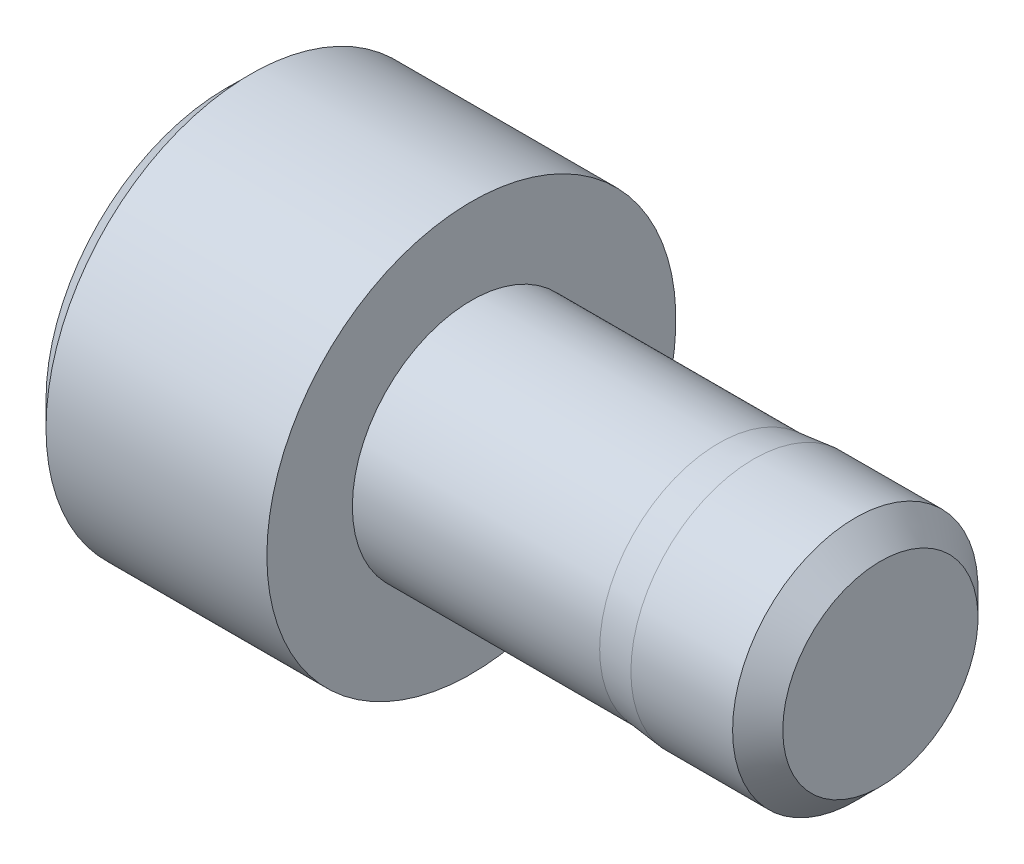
ISO-10303-21;
HEADER;
FILE_DESCRIPTION(('STEP AP214'),'2;1');
FILE_NAME('part.step','',(''),(''),'','','');
FILE_SCHEMA(('AUTOMOTIVE_DESIGN { 1 0 10303 214 1 1 1 1 }'));
ENDSEC;
DATA;
#1=APPLICATION_CONTEXT('core data for automotive mechanical design processes');
#2=APPLICATION_PROTOCOL_DEFINITION('international standard','automotive_design',2000,#1);
#3=PRODUCT_CONTEXT('',#1,'mechanical');
#4=PRODUCT('Part','Part','',(#3));
#5=PRODUCT_RELATED_PRODUCT_CATEGORY('part','',(#4));
#6=PRODUCT_DEFINITION_FORMATION('','',#4);
#7=PRODUCT_DEFINITION_CONTEXT('part definition',#1,'design');
#8=PRODUCT_DEFINITION('design','',#6,#7);
#9=PRODUCT_DEFINITION_SHAPE('','',#8);
#10=(LENGTH_UNIT() NAMED_UNIT(*) SI_UNIT(.MILLI.,.METRE.));
#11=(NAMED_UNIT(*) PLANE_ANGLE_UNIT() SI_UNIT($,.RADIAN.));
#12=(NAMED_UNIT(*) SI_UNIT($,.STERADIAN.) SOLID_ANGLE_UNIT());
#13=UNCERTAINTY_MEASURE_WITH_UNIT(LENGTH_MEASURE(1.E-05),#10,'distance_accuracy_value','');
#14=(GEOMETRIC_REPRESENTATION_CONTEXT(3) GLOBAL_UNCERTAINTY_ASSIGNED_CONTEXT((#13)) GLOBAL_UNIT_ASSIGNED_CONTEXT((#10,
#11,#12)) REPRESENTATION_CONTEXT('',''));
#15=CARTESIAN_POINT('',(0.,0.,0.));
#16=DIRECTION('',(0.,0.,1.));
#17=DIRECTION('',(1.,0.,0.));
#18=AXIS2_PLACEMENT_3D('',#15,#16,#17);
#19=CARTESIAN_POINT('',(10.,2.3865,0.));
#20=DIRECTION('',(-1.,0.,0.));
#21=DIRECTION('',(0.,0.,1.));
#22=AXIS2_PLACEMENT_3D('',#19,#20,#21);
#23=PLANE('',#22);
#24=CARTESIAN_POINT('',(9.99999999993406,0.,0.));
#25=DIRECTION('',(-1.,0.,0.));
#26=DIRECTION('',(0.,0.,1.));
#27=AXIS2_PLACEMENT_3D('',#24,#25,#26);
#28=CIRCLE('',#27,2.38650000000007);
#29=CARTESIAN_POINT('',(9.99999999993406,0.,2.38650000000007));
#30=VERTEX_POINT('',#29);
#31=EDGE_CURVE('E19',#30,#30,#28,.T.);
#32=ORIENTED_EDGE('',*,*,#31,.F.);
#33=EDGE_LOOP('',(#32));
#34=FACE_BOUND('',#33,.T.);
#35=ADVANCED_FACE('F16',(#34),#23,.F.);
#36=CARTESIAN_POINT('',(-3.,0.,0.));
#37=DIRECTION('',(1.,0.,0.));
#38=DIRECTION('',(0.,0.,-1.));
#39=AXIS2_PLACEMENT_3D('',#36,#37,#38);
#40=PLANE('',#39);
#41=DIRECTION('',(0.,1.,0.));
#42=VECTOR('',#41,1.);
#43=CARTESIAN_POINT('',(-3.,0.,2.5));
#44=LINE('',#43,#42);
#45=CARTESIAN_POINT('',(-3.,1.44337567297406,2.5));
#46=VERTEX_POINT('',#45);
#47=CARTESIAN_POINT('',(-2.99999999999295,0.,2.49999999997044));
#48=VERTEX_POINT('',#47);
#49=EDGE_CURVE('E110',#46,#48,#44,.F.);
#50=ORIENTED_EDGE('',*,*,#49,.F.);
#51=DIRECTION('',(0.,-0.500000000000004,0.866025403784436));
#52=VECTOR('',#51,1.);
#53=CARTESIAN_POINT('',(-3.,2.1650635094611,1.25));
#54=LINE('',#53,#52);
#55=CARTESIAN_POINT('',(-2.99999999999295,2.1650635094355,1.24999999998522));
#56=VERTEX_POINT('',#55);
#57=EDGE_CURVE('E92',#56,#46,#54,.T.);
#58=ORIENTED_EDGE('',*,*,#57,.F.);
#59=CARTESIAN_POINT('',(-2.9999999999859,0.,0.));
#60=DIRECTION('',(-1.,0.,0.));
#61=DIRECTION('',(0.,0.,1.));
#62=AXIS2_PLACEMENT_3D('',#59,#60,#61);
#63=CIRCLE('',#62,2.49999999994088);
#64=EDGE_CURVE('E107',#56,#48,#63,.F.);
#65=ORIENTED_EDGE('',*,*,#64,.T.);
#66=EDGE_LOOP('',(#50,#58,#65));
#67=FACE_BOUND('',#66,.T.);
#68=ADVANCED_FACE('F105',(#67),#40,.F.);
#69=CARTESIAN_POINT('',(-3.,0.,0.));
#70=DIRECTION('',(1.,0.,0.));
#71=DIRECTION('',(0.,0.,-1.));
#72=AXIS2_PLACEMENT_3D('',#69,#70,#71);
#73=PLANE('',#72);
#74=DIRECTION('',(0.,0.499999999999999,-0.866025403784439));
#75=VECTOR('',#74,1.);
#76=CARTESIAN_POINT('',(-3.,-2.88675134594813,0.));
#77=LINE('',#76,#75);
#78=CARTESIAN_POINT('',(-3.,-2.88675134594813,0.));
#79=VERTEX_POINT('',#78);
#80=CARTESIAN_POINT('',(-2.99999999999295,-2.1650635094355,-1.24999999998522));
#81=VERTEX_POINT('',#80);
#82=EDGE_CURVE('E177',#79,#81,#77,.T.);
#83=ORIENTED_EDGE('',*,*,#82,.F.);
#84=DIRECTION('',(0.,-0.499999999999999,-0.866025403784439));
#85=VECTOR('',#84,1.);
#86=CARTESIAN_POINT('',(-3.,-2.1650635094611,1.25));
#87=LINE('',#86,#85);
#88=CARTESIAN_POINT('',(-2.99999999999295,-2.1650635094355,1.24999999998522));
#89=VERTEX_POINT('',#88);
#90=EDGE_CURVE('E173',#89,#79,#87,.T.);
#91=ORIENTED_EDGE('',*,*,#90,.F.);
#92=CARTESIAN_POINT('',(-2.9999999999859,0.,0.));
#93=DIRECTION('',(-1.,0.,0.));
#94=DIRECTION('',(0.,0.,1.));
#95=AXIS2_PLACEMENT_3D('',#92,#93,#94);
#96=CIRCLE('',#95,2.49999999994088);
#97=EDGE_CURVE('E125',#89,#81,#96,.F.);
#98=ORIENTED_EDGE('',*,*,#97,.T.);
#99=EDGE_LOOP('',(#83,#91,#98));
#100=FACE_BOUND('',#99,.T.);
#101=ADVANCED_FACE('F257',(#100),#73,.F.);
#102=CARTESIAN_POINT('',(-3.,0.,0.));
#103=DIRECTION('',(1.,0.,0.));
#104=DIRECTION('',(0.,0.,-1.));
#105=AXIS2_PLACEMENT_3D('',#102,#103,#104);
#106=PLANE('',#105);
#107=DIRECTION('',(0.,1.,0.));
#108=VECTOR('',#107,1.);
#109=CARTESIAN_POINT('',(-3.,0.,-2.5));
#110=LINE('',#109,#108);
#111=CARTESIAN_POINT('',(-3.,-1.44337567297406,-2.5));
#112=VERTEX_POINT('',#111);
#113=CARTESIAN_POINT('',(-2.99999999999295,0.,-2.49999999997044));
#114=VERTEX_POINT('',#113);
#115=EDGE_CURVE('E185',#112,#114,#110,.T.);
#116=ORIENTED_EDGE('',*,*,#115,.F.);
#117=DIRECTION('',(0.,0.500000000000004,-0.866025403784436));
#118=VECTOR('',#117,1.);
#119=CARTESIAN_POINT('',(-3.,-2.1650635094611,-1.25));
#120=LINE('',#119,#118);
#121=EDGE_CURVE('E181',#81,#112,#120,.T.);
#122=ORIENTED_EDGE('',*,*,#121,.F.);
#123=CARTESIAN_POINT('',(-2.9999999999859,0.,0.));
#124=DIRECTION('',(-1.,0.,0.));
#125=DIRECTION('',(0.,0.,1.));
#126=AXIS2_PLACEMENT_3D('',#123,#124,#125);
#127=CIRCLE('',#126,2.49999999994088);
#128=EDGE_CURVE('E127',#81,#114,#127,.F.);
#129=ORIENTED_EDGE('',*,*,#128,.T.);
#130=EDGE_LOOP('',(#116,#122,#129));
#131=FACE_BOUND('',#130,.T.);
#132=ADVANCED_FACE('F263',(#131),#106,.F.);
#133=CARTESIAN_POINT('',(-3.,0.,0.));
#134=DIRECTION('',(1.,0.,0.));
#135=DIRECTION('',(0.,0.,-1.));
#136=AXIS2_PLACEMENT_3D('',#133,#134,#135);
#137=PLANE('',#136);
#138=DIRECTION('',(0.,0.500000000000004,0.866025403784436));
#139=VECTOR('',#138,1.);
#140=CARTESIAN_POINT('',(-3.,1.44337567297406,-2.5));
#141=LINE('',#140,#139);
#142=CARTESIAN_POINT('',(-3.,1.44337567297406,-2.5));
#143=VERTEX_POINT('',#142);
#144=CARTESIAN_POINT('',(-2.99999999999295,2.1650635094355,-1.24999999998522));
#145=VERTEX_POINT('',#144);
#146=EDGE_CURVE('E100',#143,#145,#141,.T.);
#147=ORIENTED_EDGE('',*,*,#146,.F.);
#148=DIRECTION('',(0.,1.,0.));
#149=VECTOR('',#148,1.);
#150=CARTESIAN_POINT('',(-3.,0.,-2.5));
#151=LINE('',#150,#149);
#152=EDGE_CURVE('E189',#114,#143,#151,.T.);
#153=ORIENTED_EDGE('',*,*,#152,.F.);
#154=CARTESIAN_POINT('',(-2.9999999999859,0.,0.));
#155=DIRECTION('',(-1.,0.,0.));
#156=DIRECTION('',(0.,0.,1.));
#157=AXIS2_PLACEMENT_3D('',#154,#155,#156);
#158=CIRCLE('',#157,2.49999999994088);
#159=EDGE_CURVE('E118',#114,#145,#158,.F.);
#160=ORIENTED_EDGE('',*,*,#159,.T.);
#161=EDGE_LOOP('',(#147,#153,#160));
#162=FACE_BOUND('',#161,.T.);
#163=ADVANCED_FACE('F266',(#162),#137,.F.);
#164=CARTESIAN_POINT('',(-3.,0.,0.));
#165=DIRECTION('',(1.,0.,0.));
#166=DIRECTION('',(0.,0.,-1.));
#167=AXIS2_PLACEMENT_3D('',#164,#165,#166);
#168=PLANE('',#167);
#169=CARTESIAN_POINT('',(-2.9999999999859,0.,0.));
#170=DIRECTION('',(-1.,0.,0.));
#171=DIRECTION('',(0.,0.,1.));
#172=AXIS2_PLACEMENT_3D('',#169,#170,#171);
#173=CIRCLE('',#172,2.49999999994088);
#174=EDGE_CURVE('E113',#145,#56,#173,.F.);
#175=ORIENTED_EDGE('',*,*,#174,.T.);
#176=DIRECTION('',(0.,-0.499999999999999,0.866025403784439));
#177=VECTOR('',#176,1.);
#178=CARTESIAN_POINT('',(-3.,2.88675134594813,0.));
#179=LINE('',#178,#177);
#180=CARTESIAN_POINT('',(-3.,2.88675134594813,0.));
#181=VERTEX_POINT('',#180);
#182=EDGE_CURVE('E88',#181,#56,#179,.T.);
#183=ORIENTED_EDGE('',*,*,#182,.F.);
#184=DIRECTION('',(0.,0.499999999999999,0.866025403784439));
#185=VECTOR('',#184,1.);
#186=CARTESIAN_POINT('',(-3.,2.1650635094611,-1.25));
#187=LINE('',#186,#185);
#188=EDGE_CURVE('E99',#145,#181,#187,.T.);
#189=ORIENTED_EDGE('',*,*,#188,.F.);
#190=EDGE_LOOP('',(#175,#183,#189));
#191=FACE_BOUND('',#190,.T.);
#192=ADVANCED_FACE('F114',(#191),#168,.F.);
#193=CARTESIAN_POINT('',(9.38650000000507,0.,0.));
#194=DIRECTION('',(-1.,0.,0.));
#195=DIRECTION('',(0.,0.,1.));
#196=AXIS2_PLACEMENT_3D('',#193,#194,#195);
#197=CONICAL_SURFACE('',#196,2.9999999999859,0.785398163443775);
#198=CARTESIAN_POINT('',(9.3865,0.,0.));
#199=DIRECTION('',(-1.,0.,0.));
#200=DIRECTION('',(0.,0.,1.));
#201=AXIS2_PLACEMENT_3D('',#198,#199,#200);
#202=CIRCLE('',#201,3.);
#203=CARTESIAN_POINT('',(9.3865,0.,3.));
#204=VERTEX_POINT('',#203);
#205=EDGE_CURVE('E117',#204,#204,#202,.T.);
#206=ORIENTED_EDGE('',*,*,#205,.F.);
#207=EDGE_LOOP('',(#206));
#208=FACE_BOUND('',#207,.T.);
#209=ORIENTED_EDGE('',*,*,#31,.T.);
#210=EDGE_LOOP('',(#209));
#211=FACE_BOUND('',#210,.T.);
#212=ADVANCED_FACE('F405',(#208,#211),#197,.T.);
#213=CARTESIAN_POINT('',(-2.9999999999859,0.,0.));
#214=DIRECTION('',(-1.,0.,0.));
#215=DIRECTION('',(0.,0.,1.));
#216=AXIS2_PLACEMENT_3D('',#213,#214,#215);
#217=CONICAL_SURFACE('',#216,2.49999999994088,1.04719755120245);
#218=CARTESIAN_POINT('',(-1.55662432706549,0.,0.));
#219=VERTEX_POINT('',#218);
#220=VERTEX_LOOP('',#219);
#221=FACE_BOUND('',#220,.T.);
#222=ORIENTED_EDGE('',*,*,#159,.F.);
#223=ORIENTED_EDGE('',*,*,#128,.F.);
#224=ORIENTED_EDGE('',*,*,#97,.F.);
#225=CARTESIAN_POINT('',(-2.9999999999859,0.,0.));
#226=DIRECTION('',(-1.,0.,0.));
#227=DIRECTION('',(0.,0.,1.));
#228=AXIS2_PLACEMENT_3D('',#225,#226,#227);
#229=CIRCLE('',#228,2.49999999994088);
#230=EDGE_CURVE('E123',#89,#48,#229,.T.);
#231=ORIENTED_EDGE('',*,*,#230,.T.);
#232=ORIENTED_EDGE('',*,*,#64,.F.);
#233=ORIENTED_EDGE('',*,*,#174,.F.);
#234=EDGE_LOOP('',(#222,#223,#224,#231,#232,#233));
#235=FACE_BOUND('',#234,.T.);
#236=ADVANCED_FACE('F120',(#221,#235),#217,.F.);
#237=CARTESIAN_POINT('',(10.,0.,0.));
#238=DIRECTION('',(-1.,0.,0.));
#239=DIRECTION('',(0.,0.,1.));
#240=AXIS2_PLACEMENT_3D('',#237,#238,#239);
#241=CYLINDRICAL_SURFACE('',#240,3.);
#242=CARTESIAN_POINT('',(6.9000000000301,0.,0.));
#243=DIRECTION('',(1.,0.,0.));
#244=DIRECTION('',(0.,0.,-1.));
#245=AXIS2_PLACEMENT_3D('',#242,#243,#244);
#246=CIRCLE('',#245,2.99999999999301);
#247=CARTESIAN_POINT('',(6.9000000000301,0.,-2.99999999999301));
#248=VERTEX_POINT('',#247);
#249=EDGE_CURVE('E136',#248,#248,#246,.F.);
#250=ORIENTED_EDGE('',*,*,#249,.F.);
#251=EDGE_LOOP('',(#250));
#252=FACE_BOUND('',#251,.T.);
#253=ORIENTED_EDGE('',*,*,#205,.T.);
#254=EDGE_LOOP('',(#253));
#255=FACE_BOUND('',#254,.T.);
#256=ADVANCED_FACE('F389',(#252,#255),#241,.T.);
#257=CARTESIAN_POINT('',(-3.,0.,0.));
#258=DIRECTION('',(1.,0.,0.));
#259=DIRECTION('',(0.,0.,-1.));
#260=AXIS2_PLACEMENT_3D('',#257,#258,#259);
#261=PLANE('',#260);
#262=DIRECTION('',(0.,0.5,0.866025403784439));
#263=VECTOR('',#262,1.);
#264=CARTESIAN_POINT('',(-3.,-1.44337567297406,2.5));
#265=LINE('',#264,#263);
#266=CARTESIAN_POINT('',(-3.,-1.44337567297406,2.5));
#267=VERTEX_POINT('',#266);
#268=EDGE_CURVE('E207',#267,#89,#265,.F.);
#269=ORIENTED_EDGE('',*,*,#268,.F.);
#270=DIRECTION('',(0.,1.,0.));
#271=VECTOR('',#270,1.);
#272=CARTESIAN_POINT('',(-3.,1.44337567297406,2.5));
#273=LINE('',#272,#271);
#274=EDGE_CURVE('E210',#48,#267,#273,.F.);
#275=ORIENTED_EDGE('',*,*,#274,.F.);
#276=ORIENTED_EDGE('',*,*,#230,.F.);
#277=EDGE_LOOP('',(#269,#275,#276));
#278=FACE_BOUND('',#277,.T.);
#279=ADVANCED_FACE('F255',(#278),#261,.F.);
#280=CARTESIAN_POINT('',(6.89999999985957,0.,0.));
#281=DIRECTION('',(1.,0.,0.));
#282=DIRECTION('',(0.,1.,0.));
#283=AXIS2_PLACEMENT_3D('',#280,#281,#282);
#284=CONICAL_SURFACE('',#283,2.9999999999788,0.10508425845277);
#285=CARTESIAN_POINT('',(6.04669926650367,0.,0.));
#286=DIRECTION('',(-1.,0.,0.));
#287=DIRECTION('',(0.,0.,1.));
#288=AXIS2_PLACEMENT_3D('',#285,#286,#287);
#289=CIRCLE('',#288,2.91);
#290=CARTESIAN_POINT('',(6.04669926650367,0.,2.91));
#291=VERTEX_POINT('',#290);
#292=EDGE_CURVE('E161',#291,#291,#289,.T.);
#293=ORIENTED_EDGE('',*,*,#292,.F.);
#294=EDGE_LOOP('',(#293));
#295=FACE_BOUND('',#294,.T.);
#296=ORIENTED_EDGE('',*,*,#249,.T.);
#297=EDGE_LOOP('',(#296));
#298=FACE_BOUND('',#297,.T.);
#299=ADVANCED_FACE('F373',(#295,#298),#284,.T.);
#300=CARTESIAN_POINT('',(-3.,-1.44337567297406,2.5));
#301=DIRECTION('',(0.,0.866025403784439,-0.5));
#302=DIRECTION('',(0.,0.5,0.866025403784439));
#303=AXIS2_PLACEMENT_3D('',#300,#301,#302);
#304=PLANE('',#303);
#305=ORIENTED_EDGE('',*,*,#90,.T.);
#306=DIRECTION('',(1.,0.,0.));
#307=VECTOR('',#306,1.);
#308=CARTESIAN_POINT('',(-3.,-2.88675134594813,0.));
#309=LINE('',#308,#307);
#310=CARTESIAN_POINT('',(-6.,-2.88675134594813,0.));
#311=VERTEX_POINT('',#310);
#312=EDGE_CURVE('E153',#311,#79,#309,.T.);
#313=ORIENTED_EDGE('',*,*,#312,.F.);
#314=DIRECTION('',(0.,0.500000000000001,0.866025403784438));
#315=VECTOR('',#314,1.);
#316=CARTESIAN_POINT('',(-6.,-2.88675134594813,0.));
#317=LINE('',#316,#315);
#318=CARTESIAN_POINT('',(-6.,-1.44337567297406,2.5));
#319=VERTEX_POINT('',#318);
#320=EDGE_CURVE('E227',#311,#319,#317,.T.);
#321=ORIENTED_EDGE('',*,*,#320,.T.);
#322=DIRECTION('',(-1.,0.,0.));
#323=VECTOR('',#322,1.);
#324=CARTESIAN_POINT('',(-3.,-1.44337567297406,2.5));
#325=LINE('',#324,#323);
#326=EDGE_CURVE('E150',#267,#319,#325,.T.);
#327=ORIENTED_EDGE('',*,*,#326,.F.);
#328=ORIENTED_EDGE('',*,*,#268,.T.);
#329=EDGE_LOOP('',(#305,#313,#321,#327,#328));
#330=FACE_BOUND('',#329,.T.);
#331=ADVANCED_FACE('F251',(#330),#304,.T.);
#332=CARTESIAN_POINT('',(-3.,1.44337567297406,2.5));
#333=DIRECTION('',(0.,0.,-1.));
#334=DIRECTION('',(-1.,0.,0.));
#335=AXIS2_PLACEMENT_3D('',#332,#333,#334);
#336=PLANE('',#335);
#337=ORIENTED_EDGE('',*,*,#274,.T.);
#338=ORIENTED_EDGE('',*,*,#326,.T.);
#339=DIRECTION('',(0.,1.,0.));
#340=VECTOR('',#339,1.);
#341=CARTESIAN_POINT('',(-6.,0.,2.5));
#342=LINE('',#341,#340);
#343=CARTESIAN_POINT('',(-6.,1.44337567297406,2.5));
#344=VERTEX_POINT('',#343);
#345=EDGE_CURVE('E229',#319,#344,#342,.T.);
#346=ORIENTED_EDGE('',*,*,#345,.T.);
#347=DIRECTION('',(1.,0.,0.));
#348=VECTOR('',#347,1.);
#349=CARTESIAN_POINT('',(-3.,1.44337567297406,2.5));
#350=LINE('',#349,#348);
#351=EDGE_CURVE('E148',#46,#344,#350,.F.);
#352=ORIENTED_EDGE('',*,*,#351,.F.);
#353=ORIENTED_EDGE('',*,*,#49,.T.);
#354=EDGE_LOOP('',(#337,#338,#346,#352,#353));
#355=FACE_BOUND('',#354,.T.);
#356=ADVANCED_FACE('F253',(#355),#336,.T.);
#357=CARTESIAN_POINT('',(-3.,2.88675134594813,0.));
#358=DIRECTION('',(0.,-0.866025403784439,-0.5));
#359=DIRECTION('',(0.,0.5,-0.866025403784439));
#360=AXIS2_PLACEMENT_3D('',#357,#358,#359);
#361=PLANE('',#360);
#362=ORIENTED_EDGE('',*,*,#57,.T.);
#363=ORIENTED_EDGE('',*,*,#351,.T.);
#364=DIRECTION('',(0.,0.500000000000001,-0.866025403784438));
#365=VECTOR('',#364,1.);
#366=CARTESIAN_POINT('',(-6.,1.44337567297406,2.5));
#367=LINE('',#366,#365);
#368=CARTESIAN_POINT('',(-6.,2.88675134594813,0.));
#369=VERTEX_POINT('',#368);
#370=EDGE_CURVE('E231',#344,#369,#367,.T.);
#371=ORIENTED_EDGE('',*,*,#370,.T.);
#372=DIRECTION('',(1.,0.,0.));
#373=VECTOR('',#372,1.);
#374=CARTESIAN_POINT('',(-3.,2.88675134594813,0.));
#375=LINE('',#374,#373);
#376=EDGE_CURVE('E95',#181,#369,#375,.F.);
#377=ORIENTED_EDGE('',*,*,#376,.F.);
#378=ORIENTED_EDGE('',*,*,#182,.T.);
#379=EDGE_LOOP('',(#362,#363,#371,#377,#378));
#380=FACE_BOUND('',#379,.T.);
#381=ADVANCED_FACE('F90',(#380),#361,.T.);
#382=CARTESIAN_POINT('',(-3.,1.44337567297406,-2.5));
#383=DIRECTION('',(0.,-0.866025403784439,0.5));
#384=DIRECTION('',(0.,-0.5,-0.866025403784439));
#385=AXIS2_PLACEMENT_3D('',#382,#383,#384);
#386=PLANE('',#385);
#387=ORIENTED_EDGE('',*,*,#188,.T.);
#388=ORIENTED_EDGE('',*,*,#376,.T.);
#389=DIRECTION('',(0.,-0.500000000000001,-0.866025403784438));
#390=VECTOR('',#389,1.);
#391=CARTESIAN_POINT('',(-6.,2.88675134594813,0.));
#392=LINE('',#391,#390);
#393=CARTESIAN_POINT('',(-6.,1.44337567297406,-2.5));
#394=VERTEX_POINT('',#393);
#395=EDGE_CURVE('E233',#369,#394,#392,.T.);
#396=ORIENTED_EDGE('',*,*,#395,.T.);
#397=DIRECTION('',(1.,0.,0.));
#398=VECTOR('',#397,1.);
#399=CARTESIAN_POINT('',(-3.,1.44337567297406,-2.5));
#400=LINE('',#399,#398);
#401=EDGE_CURVE('E157',#143,#394,#400,.F.);
#402=ORIENTED_EDGE('',*,*,#401,.F.);
#403=ORIENTED_EDGE('',*,*,#146,.T.);
#404=EDGE_LOOP('',(#387,#388,#396,#402,#403));
#405=FACE_BOUND('',#404,.T.);
#406=ADVANCED_FACE('F270',(#405),#386,.T.);
#407=CARTESIAN_POINT('',(-3.,-1.44337567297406,-2.5));
#408=DIRECTION('',(0.,0.,1.));
#409=DIRECTION('',(1.,0.,0.));
#410=AXIS2_PLACEMENT_3D('',#407,#408,#409);
#411=PLANE('',#410);
#412=ORIENTED_EDGE('',*,*,#152,.T.);
#413=ORIENTED_EDGE('',*,*,#401,.T.);
#414=DIRECTION('',(0.,1.,0.));
#415=VECTOR('',#414,1.);
#416=CARTESIAN_POINT('',(-6.,0.,-2.5));
#417=LINE('',#416,#415);
#418=CARTESIAN_POINT('',(-6.,-1.44337567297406,-2.5));
#419=VERTEX_POINT('',#418);
#420=EDGE_CURVE('E34',#394,#419,#417,.F.);
#421=ORIENTED_EDGE('',*,*,#420,.T.);
#422=DIRECTION('',(1.,0.,0.));
#423=VECTOR('',#422,1.);
#424=CARTESIAN_POINT('',(-3.,-1.44337567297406,-2.5));
#425=LINE('',#424,#423);
#426=EDGE_CURVE('E156',#112,#419,#425,.F.);
#427=ORIENTED_EDGE('',*,*,#426,.F.);
#428=ORIENTED_EDGE('',*,*,#115,.T.);
#429=EDGE_LOOP('',(#412,#413,#421,#427,#428));
#430=FACE_BOUND('',#429,.T.);
#431=ADVANCED_FACE('F268',(#430),#411,.T.);
#432=CARTESIAN_POINT('',(-3.,-2.88675134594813,0.));
#433=DIRECTION('',(0.,0.866025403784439,0.5));
#434=DIRECTION('',(0.,-0.5,0.866025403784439));
#435=AXIS2_PLACEMENT_3D('',#432,#433,#434);
#436=PLANE('',#435);
#437=ORIENTED_EDGE('',*,*,#121,.T.);
#438=ORIENTED_EDGE('',*,*,#426,.T.);
#439=DIRECTION('',(0.,-0.500000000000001,0.866025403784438));
#440=VECTOR('',#439,1.);
#441=CARTESIAN_POINT('',(-6.,-1.44337567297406,-2.5));
#442=LINE('',#441,#440);
#443=EDGE_CURVE('E141',#419,#311,#442,.T.);
#444=ORIENTED_EDGE('',*,*,#443,.T.);
#445=ORIENTED_EDGE('',*,*,#312,.T.);
#446=ORIENTED_EDGE('',*,*,#82,.T.);
#447=EDGE_LOOP('',(#437,#438,#444,#445,#446));
#448=FACE_BOUND('',#447,.T.);
#449=ADVANCED_FACE('F242',(#448),#436,.T.);
#450=CARTESIAN_POINT('',(10.,0.,0.));
#451=DIRECTION('',(-1.,0.,0.));
#452=DIRECTION('',(0.,0.,1.));
#453=AXIS2_PLACEMENT_3D('',#450,#451,#452);
#454=CYLINDRICAL_SURFACE('',#453,2.91);
#455=CARTESIAN_POINT('',(0.,0.,0.));
#456=DIRECTION('',(-1.,0.,0.));
#457=DIRECTION('',(0.,0.,1.));
#458=AXIS2_PLACEMENT_3D('',#455,#456,#457);
#459=CIRCLE('',#458,2.91);
#460=CARTESIAN_POINT('',(0.,0.,2.91));
#461=VERTEX_POINT('',#460);
#462=EDGE_CURVE('E137',#461,#461,#459,.F.);
#463=ORIENTED_EDGE('',*,*,#462,.T.);
#464=EDGE_LOOP('',(#463));
#465=FACE_BOUND('',#464,.T.);
#466=ORIENTED_EDGE('',*,*,#292,.T.);
#467=EDGE_LOOP('',(#466));
#468=FACE_BOUND('',#467,.T.);
#469=ADVANCED_FACE('F299',(#465,#468),#454,.T.);
#470=CARTESIAN_POINT('',(-6.,0.,0.));
#471=DIRECTION('',(1.,0.,0.));
#472=DIRECTION('',(0.,0.,-1.));
#473=AXIS2_PLACEMENT_3D('',#470,#471,#472);
#474=PLANE('',#473);
#475=ORIENTED_EDGE('',*,*,#420,.F.);
#476=ORIENTED_EDGE('',*,*,#395,.F.);
#477=ORIENTED_EDGE('',*,*,#370,.F.);
#478=ORIENTED_EDGE('',*,*,#345,.F.);
#479=ORIENTED_EDGE('',*,*,#320,.F.);
#480=ORIENTED_EDGE('',*,*,#443,.F.);
#481=EDGE_LOOP('',(#475,#476,#477,#478,#479,#480));
#482=FACE_BOUND('',#481,.T.);
#483=CARTESIAN_POINT('',(-5.99999999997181,0.,0.));
#484=DIRECTION('',(1.,0.,0.));
#485=DIRECTION('',(0.,0.,-1.));
#486=AXIS2_PLACEMENT_3D('',#483,#484,#485);
#487=CIRCLE('',#486,4.39999999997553);
#488=CARTESIAN_POINT('',(-5.99999999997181,0.,-4.39999999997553));
#489=VERTEX_POINT('',#488);
#490=EDGE_CURVE('E140',#489,#489,#487,.T.);
#491=ORIENTED_EDGE('',*,*,#490,.F.);
#492=EDGE_LOOP('',(#491));
#493=FACE_BOUND('',#492,.T.);
#494=ADVANCED_FACE('F246',(#482,#493),#474,.F.);
#495=CARTESIAN_POINT('',(0.,5.,0.));
#496=DIRECTION('',(-1.,0.,0.));
#497=DIRECTION('',(0.,0.,1.));
#498=AXIS2_PLACEMENT_3D('',#495,#496,#497);
#499=PLANE('',#498);
#500=CARTESIAN_POINT('',(0.,0.,0.));
#501=DIRECTION('',(-1.,0.,0.));
#502=DIRECTION('',(0.,0.,1.));
#503=AXIS2_PLACEMENT_3D('',#500,#501,#502);
#504=CIRCLE('',#503,5.);
#505=CARTESIAN_POINT('',(0.,0.,5.));
#506=VERTEX_POINT('',#505);
#507=EDGE_CURVE('E25',#506,#506,#504,.T.);
#508=ORIENTED_EDGE('',*,*,#507,.F.);
#509=EDGE_LOOP('',(#508));
#510=FACE_BOUND('',#509,.T.);
#511=ORIENTED_EDGE('',*,*,#462,.F.);
#512=EDGE_LOOP('',(#511));
#513=FACE_BOUND('',#512,.T.);
#514=ADVANCED_FACE('F289',(#510,#513),#499,.F.);
#515=CARTESIAN_POINT('',(-5.40000000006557,0.,0.));
#516=DIRECTION('',(1.,0.,0.));
#517=DIRECTION('',(0.,0.,-1.));
#518=AXIS2_PLACEMENT_3D('',#515,#516,#517);
#519=CONICAL_SURFACE('',#518,4.99999999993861,0.785398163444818);
#520=ORIENTED_EDGE('',*,*,#490,.T.);
#521=EDGE_LOOP('',(#520));
#522=FACE_BOUND('',#521,.T.);
#523=CARTESIAN_POINT('',(-5.4,0.,0.));
#524=DIRECTION('',(-1.,0.,0.));
#525=DIRECTION('',(0.,0.,1.));
#526=AXIS2_PLACEMENT_3D('',#523,#524,#525);
#527=CIRCLE('',#526,5.);
#528=CARTESIAN_POINT('',(-5.4,0.,5.));
#529=VERTEX_POINT('',#528);
#530=EDGE_CURVE('E11',#529,#529,#527,.F.);
#531=ORIENTED_EDGE('',*,*,#530,.F.);
#532=EDGE_LOOP('',(#531));
#533=FACE_BOUND('',#532,.T.);
#534=ADVANCED_FACE('F283',(#522,#533),#519,.T.);
#535=CARTESIAN_POINT('',(10.,0.,0.));
#536=DIRECTION('',(-1.,0.,0.));
#537=DIRECTION('',(0.,0.,1.));
#538=AXIS2_PLACEMENT_3D('',#535,#536,#537);
#539=CYLINDRICAL_SURFACE('',#538,5.);
#540=ORIENTED_EDGE('',*,*,#530,.T.);
#541=EDGE_LOOP('',(#540));
#542=FACE_BOUND('',#541,.T.);
#543=ORIENTED_EDGE('',*,*,#507,.T.);
#544=EDGE_LOOP('',(#543));
#545=FACE_BOUND('',#544,.T.);
#546=ADVANCED_FACE('F281',(#542,#545),#539,.T.);
#547=CLOSED_SHELL('',(#35,#68,#101,#132,#163,#192,#212,#236,#256,#279,#299,#331,#356,#381,#406,
#431,#449,#469,#494,#514,#534,#546));
#548=MANIFOLD_SOLID_BREP('B1',#547);
#549=ADVANCED_BREP_SHAPE_REPRESENTATION('',(#18,#548),#14);
#550=SHAPE_DEFINITION_REPRESENTATION(#9,#549);
ENDSEC;
END-ISO-10303-21;
